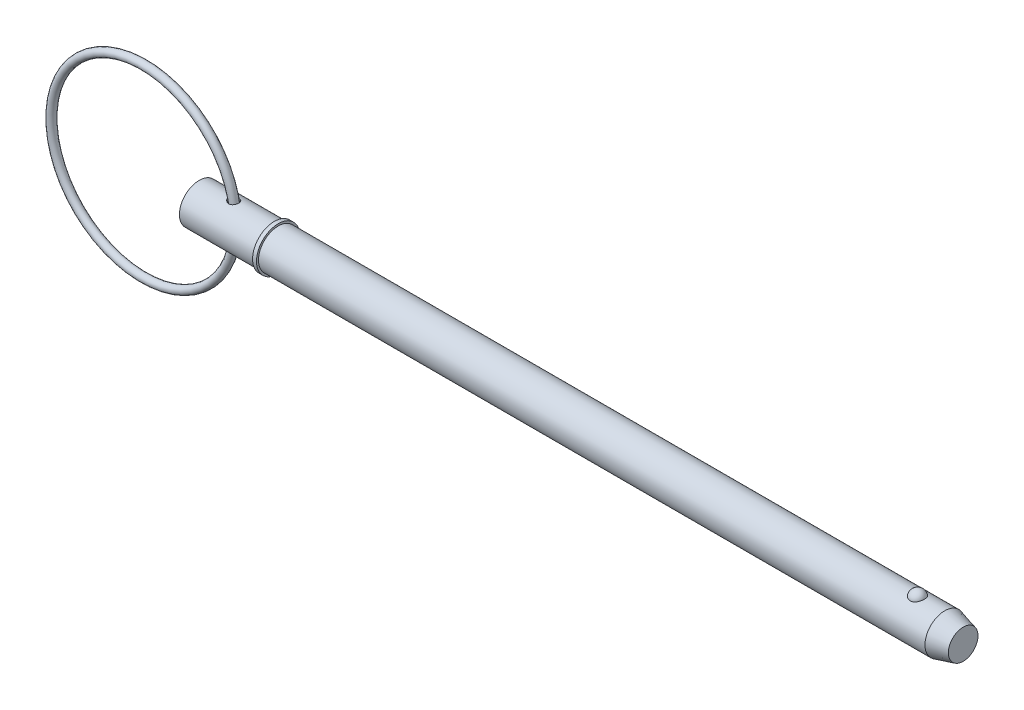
ISO-10303-21;
HEADER;
FILE_DESCRIPTION(('STEP AP214'),'2;1');
FILE_NAME('part.step','',(''),(''),'','','');
FILE_SCHEMA(('AUTOMOTIVE_DESIGN { 1 0 10303 214 1 1 1 1 }'));
ENDSEC;
DATA;
#1=APPLICATION_CONTEXT('core data for automotive mechanical design processes');
#2=APPLICATION_PROTOCOL_DEFINITION('international standard','automotive_design',2000,#1);
#3=PRODUCT_CONTEXT('',#1,'mechanical');
#4=PRODUCT('Part','Part','',(#3));
#5=PRODUCT_RELATED_PRODUCT_CATEGORY('part','',(#4));
#6=PRODUCT_DEFINITION_FORMATION('','',#4);
#7=PRODUCT_DEFINITION_CONTEXT('part definition',#1,'design');
#8=PRODUCT_DEFINITION('design','',#6,#7);
#9=PRODUCT_DEFINITION_SHAPE('','',#8);
#10=(LENGTH_UNIT() NAMED_UNIT(*) SI_UNIT(.MILLI.,.METRE.));
#11=(NAMED_UNIT(*) PLANE_ANGLE_UNIT() SI_UNIT($,.RADIAN.));
#12=(NAMED_UNIT(*) SI_UNIT($,.STERADIAN.) SOLID_ANGLE_UNIT());
#13=UNCERTAINTY_MEASURE_WITH_UNIT(LENGTH_MEASURE(1.E-05),#10,'distance_accuracy_value','');
#14=(GEOMETRIC_REPRESENTATION_CONTEXT(3) GLOBAL_UNCERTAINTY_ASSIGNED_CONTEXT((#13)) GLOBAL_UNIT_ASSIGNED_CONTEXT((#10,
#11,#12)) REPRESENTATION_CONTEXT('',''));
#15=CARTESIAN_POINT('',(0.,0.,0.));
#16=DIRECTION('',(0.,0.,1.));
#17=DIRECTION('',(1.,0.,0.));
#18=AXIS2_PLACEMENT_3D('',#15,#16,#17);
#19=CARTESIAN_POINT('',(-13.4013067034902,0.,0.));
#20=DIRECTION('',(0.,0.,1.));
#21=DIRECTION('',(1.,0.,0.));
#22=AXIS2_PLACEMENT_3D('',#19,#20,#21);
#23=TOROIDAL_SURFACE('',#22,22.225,0.952999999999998);
#24=CARTESIAN_POINT('',(9.77669329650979,0.,0.));
#25=VERTEX_POINT('',#24);
#26=VERTEX_LOOP('',#25);
#27=FACE_BOUND('',#26,.T.);
#28=ADVANCED_FACE('P0_F12',(#27),#23,.T.);
#29=CLOSED_SHELL('',(#28));
#30=MANIFOLD_SOLID_BREP('P0_B1',#29);
#31=CARTESIAN_POINT('',(0.,0.,0.));
#32=DIRECTION('',(1.,0.,0.));
#33=DIRECTION('',(0.,0.,-1.));
#34=AXIS2_PLACEMENT_3D('',#31,#32,#33);
#35=CYLINDRICAL_SURFACE('',#34,4.765);
#36=CARTESIAN_POINT('',(7.31773584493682,4.71580709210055,-0.682926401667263));
#37=CARTESIAN_POINT('',(7.3607471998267,4.70750812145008,-0.740230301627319));
#38=CARTESIAN_POINT('',(7.40883112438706,4.69869300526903,-0.79371122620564));
#39=CARTESIAN_POINT('',(7.51340999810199,4.68106981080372,-0.89180043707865));
#40=CARTESIAN_POINT('',(7.56991882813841,4.67226176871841,-0.936393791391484));
#41=CARTESIAN_POINT('',(7.689548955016,4.65568581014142,-1.01560363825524));
#42=CARTESIAN_POINT('',(7.75265928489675,4.64791621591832,-1.05023633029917));
#43=CARTESIAN_POINT('',(7.88387110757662,4.6343185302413,-1.10870278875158));
#44=CARTESIAN_POINT('',(7.95197058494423,4.62848966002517,-1.13254088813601));
#45=CARTESIAN_POINT('',(8.09209413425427,4.6194749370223,-1.16877415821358));
#46=CARTESIAN_POINT('',(8.16415141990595,4.6163169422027,-1.18104886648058));
#47=CARTESIAN_POINT('',(8.30937958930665,4.61324608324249,-1.19299123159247));
#48=CARTESIAN_POINT('',(8.38255011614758,4.61333220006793,-1.19266284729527));
#49=CARTESIAN_POINT('',(8.52374186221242,4.61674026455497,-1.17939593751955));
#50=CARTESIAN_POINT('',(8.59183022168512,4.61989017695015,-1.16712781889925));
#51=CARTESIAN_POINT('',(8.72470143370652,4.62884731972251,-1.13107903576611));
#52=CARTESIAN_POINT('',(8.78948513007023,4.63465386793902,-1.10730132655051));
#53=CARTESIAN_POINT('',(8.91088768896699,4.64792402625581,-1.05016249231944));
#54=CARTESIAN_POINT('',(8.96774302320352,4.65530108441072,-1.01728198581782));
#55=CARTESIAN_POINT('',(9.07499804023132,4.67102002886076,-0.942471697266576));
#56=CARTESIAN_POINT('',(9.12539777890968,4.6793619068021,-0.900541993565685));
#57=CARTESIAN_POINT('',(9.21836221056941,4.69607497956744,-0.808868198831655));
#58=CARTESIAN_POINT('',(9.26093651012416,4.70444612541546,-0.759133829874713));
#59=CARTESIAN_POINT('',(9.33728390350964,4.72032100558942,-0.653192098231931));
#60=CARTESIAN_POINT('',(9.3710564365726,4.72782468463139,-0.596984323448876));
#61=CARTESIAN_POINT('',(9.42940600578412,4.74126034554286,-0.478808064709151));
#62=CARTESIAN_POINT('',(9.45384681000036,4.74716869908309,-0.416769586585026));
#63=CARTESIAN_POINT('',(9.49226260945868,4.75663465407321,-0.289362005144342));
#64=CARTESIAN_POINT('',(9.50623742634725,4.76019221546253,-0.22399284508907));
#65=CARTESIAN_POINT('',(9.52342004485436,4.76458450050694,-0.0914886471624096));
#66=CARTESIAN_POINT('',(9.52658321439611,4.7654079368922,-0.0243474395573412));
#67=CARTESIAN_POINT('',(9.52194012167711,4.76421136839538,0.109528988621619));
#68=CARTESIAN_POINT('',(9.51413380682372,4.7621913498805,0.176264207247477));
#69=CARTESIAN_POINT('',(9.48775485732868,4.75552896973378,0.307367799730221));
#70=CARTESIAN_POINT('',(9.4691926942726,4.75088915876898,0.371738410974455));
#71=CARTESIAN_POINT('',(9.42175836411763,4.73949008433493,0.496364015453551));
#72=CARTESIAN_POINT('',(9.39288586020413,4.73273075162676,0.556618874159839));
#73=CARTESIAN_POINT('',(9.32549385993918,4.71782154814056,0.671371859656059));
#74=CARTESIAN_POINT('',(9.28696367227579,4.70967013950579,0.725863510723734));
#75=CARTESIAN_POINT('',(9.20123305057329,4.6928883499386,0.827453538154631));
#76=CARTESIAN_POINT('',(9.15403300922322,4.68425799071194,0.874552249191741));
#77=CARTESIAN_POINT('',(9.05250467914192,4.66754854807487,0.959736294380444));
#78=CARTESIAN_POINT('',(8.99822095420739,4.65946646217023,0.997874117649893));
#79=CARTESIAN_POINT('',(8.88381123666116,4.64472049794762,1.06440739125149));
#80=CARTESIAN_POINT('',(8.82368614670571,4.63805640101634,1.09280434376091));
#81=CARTESIAN_POINT('',(8.70022952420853,4.62698068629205,1.13878427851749));
#82=CARTESIAN_POINT('',(8.63695594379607,4.62253830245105,1.15651569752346));
#83=CARTESIAN_POINT('',(8.50825296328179,4.61622454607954,1.18146656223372));
#84=CARTESIAN_POINT('',(8.44282353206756,4.61435321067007,1.18868585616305));
#85=CARTESIAN_POINT('',(8.31119087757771,4.61332122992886,1.19268442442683));
#86=CARTESIAN_POINT('',(8.24498542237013,4.61417920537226,1.18939198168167));
#87=CARTESIAN_POINT('',(8.11397487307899,4.61847671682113,1.17259121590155));
#88=CARTESIAN_POINT('',(8.04917011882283,4.62191687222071,1.15908044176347));
#89=CARTESIAN_POINT('',(7.91946226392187,4.63117528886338,1.12153047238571));
#90=CARTESIAN_POINT('',(7.85470460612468,4.6371000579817,1.09701575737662));
#91=CARTESIAN_POINT('',(7.7300035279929,4.65063246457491,1.03814807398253));
#92=CARTESIAN_POINT('',(7.67006197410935,4.65824075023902,1.00379131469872));
#93=CARTESIAN_POINT('',(7.55352765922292,4.67473656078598,0.924015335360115));
#94=CARTESIAN_POINT('',(7.49726947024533,4.68366994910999,0.878115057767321));
#95=CARTESIAN_POINT('',(7.39344083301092,4.70144936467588,0.777311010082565));
#96=CARTESIAN_POINT('',(7.34587087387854,4.71029538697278,0.722406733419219));
#97=CARTESIAN_POINT('',(7.26188955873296,4.72669773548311,0.605773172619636));
#98=CARTESIAN_POINT('',(7.22531316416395,4.73427229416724,0.544165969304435));
#99=CARTESIAN_POINT('',(7.16406269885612,4.74732663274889,0.415095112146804));
#100=CARTESIAN_POINT('',(7.13937848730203,4.75280819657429,0.347636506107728));
#101=CARTESIAN_POINT('',(7.10494917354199,4.7605495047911,0.215359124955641));
#102=CARTESIAN_POINT('',(7.09405441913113,4.76305589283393,0.150853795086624));
#103=CARTESIAN_POINT('',(7.08387189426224,4.76539656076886,0.0208839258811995));
#104=CARTESIAN_POINT('',(7.0845805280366,4.76523166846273,-0.0445803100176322));
#105=CARTESIAN_POINT('',(7.09709111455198,4.76236014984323,-0.169693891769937));
#106=CARTESIAN_POINT('',(7.10810913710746,4.75983315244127,-0.229428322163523));
#107=CARTESIAN_POINT('',(7.13959099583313,4.75276726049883,-0.346187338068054));
#108=CARTESIAN_POINT('',(7.16004881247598,4.7482296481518,-0.403213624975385));
#109=CARTESIAN_POINT('',(7.20270325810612,4.73907067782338,-0.498040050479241));
#110=CARTESIAN_POINT('',(7.22286864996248,4.73481668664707,-0.536809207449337));
#111=CARTESIAN_POINT('',(7.26730952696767,4.72570777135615,-0.611832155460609));
#112=CARTESIAN_POINT('',(7.29158512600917,4.72085283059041,-0.64808587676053));
#113=CARTESIAN_POINT('',(7.31773584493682,4.71580709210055,-0.682926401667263));
#114=B_SPLINE_CURVE_WITH_KNOTS('',3,(#36,#37,#38,#39,#40,#41,#42,#43,#44,#45,#46,#47,#48,#49,
#50,#51,#52,#53,#54,#55,#56,#57,#58,#59,#60,#61,#62,#63,#64,#65,#66,#67,#68,#69,#70,#71,#72,#73,
#74,#75,#76,#77,#78,#79,#80,#81,#82,#83,#84,#85,#86,#87,#88,#89,#90,#91,#92,#93,#94,#95,#96,#97,
#98,#99,#100,#101,#102,#103,#104,#105,#106,#107,#108,#109,#110,#111,#112,#113),.UNSPECIFIED.,
.T.,.F.,(4,2,2,2,2,2,2,2,2,2,2,2,2,2,2,2,2,2,2,2,2,2,2,2,2,2,2,2,2,2,2,2,2,2,2,2,2,2,4),(0.,
0.216219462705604,0.432799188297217,0.649024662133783,0.865163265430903,1.08352938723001,
1.30182691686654,1.50853487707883,1.71518978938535,1.91252381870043,2.1098561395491,
2.30694457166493,2.50404555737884,2.70392296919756,2.90380378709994,3.10450875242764,
3.30521468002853,3.5057255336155,3.70624293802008,3.90698330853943,4.10771458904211,
4.30723900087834,4.50673262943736,4.70338139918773,4.90003300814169,5.09802914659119,
5.29607279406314,5.5036500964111,5.7113074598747,5.92972727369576,6.14815938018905,
6.36312650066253,6.57790998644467,6.77325899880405,6.96854747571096,7.15009726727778,
7.33153144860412,7.46298830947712,7.59444881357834),.UNSPECIFIED.);
#115=CARTESIAN_POINT('',(7.31773584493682,4.71580709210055,-0.682926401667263));
#116=VERTEX_POINT('',#115);
#117=EDGE_CURVE('P1_E42',#116,#116,#114,.T.);
#118=ORIENTED_EDGE('',*,*,#117,.T.);
#119=EDGE_LOOP('',(#118));
#120=FACE_BOUND('',#119,.T.);
#121=CARTESIAN_POINT('',(0.,0.,0.));
#122=DIRECTION('',(1.,0.,0.));
#123=DIRECTION('',(0.,0.,-1.));
#124=AXIS2_PLACEMENT_3D('',#121,#122,#123);
#125=CIRCLE('',#124,4.765);
#126=CARTESIAN_POINT('',(0.,0.,-4.765));
#127=VERTEX_POINT('',#126);
#128=EDGE_CURVE('P1_E9',#127,#127,#125,.T.);
#129=ORIENTED_EDGE('',*,*,#128,.T.);
#130=EDGE_LOOP('',(#129));
#131=FACE_BOUND('',#130,.T.);
#132=CARTESIAN_POINT('',(18.097,0.,0.));
#133=DIRECTION('',(1.,0.,0.));
#134=DIRECTION('',(0.,0.,-1.));
#135=AXIS2_PLACEMENT_3D('',#132,#133,#134);
#136=CIRCLE('',#135,4.765);
#137=CARTESIAN_POINT('',(18.097,0.,-4.765));
#138=VERTEX_POINT('',#137);
#139=EDGE_CURVE('P1_E25',#138,#138,#136,.T.);
#140=ORIENTED_EDGE('',*,*,#139,.F.);
#141=EDGE_LOOP('',(#140));
#142=FACE_BOUND('',#141,.T.);
#143=CARTESIAN_POINT('',(7.31773584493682,-4.71580709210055,-0.682926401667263));
#144=CARTESIAN_POINT('',(7.27956054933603,-4.72317282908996,-0.63206220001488));
#145=CARTESIAN_POINT('',(7.24535712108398,-4.7301361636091,-0.578155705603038));
#146=CARTESIAN_POINT('',(7.18611785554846,-4.74256090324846,-0.465352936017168));
#147=CARTESIAN_POINT('',(7.16107836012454,-4.74802290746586,-0.406458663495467));
#148=CARTESIAN_POINT('',(7.12119149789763,-4.75686558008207,-0.284913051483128));
#149=CARTESIAN_POINT('',(7.1063796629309,-4.76023898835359,-0.222249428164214));
#150=CARTESIAN_POINT('',(7.08786546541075,-4.76447177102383,-0.0952170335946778));
#151=CARTESIAN_POINT('',(7.08416018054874,-4.76533180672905,-0.0308487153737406));
#152=CARTESIAN_POINT('',(7.08795686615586,-4.76445764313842,0.0942755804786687));
#153=CARTESIAN_POINT('',(7.09490366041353,-4.762851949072,0.155050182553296));
#154=CARTESIAN_POINT('',(7.11863973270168,-4.75746086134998,0.2745356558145));
#155=CARTESIAN_POINT('',(7.13542953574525,-4.75367535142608,0.333246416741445));
#156=CARTESIAN_POINT('',(7.17817193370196,-4.74430545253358,0.447305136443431));
#157=CARTESIAN_POINT('',(7.20415836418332,-4.73871442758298,0.502639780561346));
#158=CARTESIAN_POINT('',(7.26428068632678,-4.72628508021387,0.608523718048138));
#159=CARTESIAN_POINT('',(7.29841897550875,-4.71944639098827,0.659071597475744));
#160=CARTESIAN_POINT('',(7.37680984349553,-4.70456239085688,0.758311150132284));
#161=CARTESIAN_POINT('',(7.42165519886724,-4.69646426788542,0.806526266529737));
#162=CARTESIAN_POINT('',(7.51828933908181,-4.68032890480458,0.895428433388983));
#163=CARTESIAN_POINT('',(7.57008134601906,-4.67229169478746,0.936111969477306));
#164=CARTESIAN_POINT('',(7.68397204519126,-4.65640659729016,1.01229731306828));
#165=CARTESIAN_POINT('',(7.74657226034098,-4.64863251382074,1.04706751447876));
#166=CARTESIAN_POINT('',(7.87680110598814,-4.6349740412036,1.10596507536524));
#167=CARTESIAN_POINT('',(7.94443054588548,-4.62908995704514,1.13009071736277));
#168=CARTESIAN_POINT('',(8.08402017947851,-4.61989019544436,1.16713943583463));
#169=CARTESIAN_POINT('',(8.15603143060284,-4.61661596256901,1.17988211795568));
#170=CARTESIAN_POINT('',(8.30124697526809,-4.61330446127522,1.1927680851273));
#171=CARTESIAN_POINT('',(8.37445077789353,-4.61326589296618,1.19291642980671));
#172=CARTESIAN_POINT('',(8.51584800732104,-4.61644036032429,1.18056687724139));
#173=CARTESIAN_POINT('',(8.58410302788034,-4.61948317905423,1.16873099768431));
#174=CARTESIAN_POINT('',(8.71738052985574,-4.6282520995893,1.13350536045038));
#175=CARTESIAN_POINT('',(8.78240382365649,-4.63397752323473,1.11011852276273));
#176=CARTESIAN_POINT('',(8.90428519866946,-4.64711877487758,1.05371003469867));
#177=CARTESIAN_POINT('',(8.96138096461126,-4.6544450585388,1.02117932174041));
#178=CARTESIAN_POINT('',(9.06916653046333,-4.6700970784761,0.947021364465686));
#179=CARTESIAN_POINT('',(9.11985639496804,-4.67842280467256,0.905394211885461));
#180=CARTESIAN_POINT('',(9.2134071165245,-4.69513303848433,0.814300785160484));
#181=CARTESIAN_POINT('',(9.25628268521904,-4.70351740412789,0.764849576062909));
#182=CARTESIAN_POINT('',(9.33327173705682,-4.71945185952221,0.659422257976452));
#183=CARTESIAN_POINT('',(9.3673846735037,-4.72700189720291,0.603445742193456));
#184=CARTESIAN_POINT('',(9.42645214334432,-4.74055953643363,0.485673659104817));
#185=CARTESIAN_POINT('',(9.45127042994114,-4.74654383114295,0.423807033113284));
#186=CARTESIAN_POINT('',(9.49046298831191,-4.756182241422,0.296676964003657));
#187=CARTESIAN_POINT('',(9.50483706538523,-4.75983631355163,0.231413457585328));
#188=CARTESIAN_POINT('',(9.52283408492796,-4.76443282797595,0.0990368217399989));
#189=CARTESIAN_POINT('',(9.52641016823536,-4.76536345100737,0.0319169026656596));
#190=CARTESIAN_POINT('',(9.52259067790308,-4.76437893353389,-0.101988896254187));
#191=CARTESIAN_POINT('',(9.5151950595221,-4.76246378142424,-0.168774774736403));
#192=CARTESIAN_POINT('',(9.48962516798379,-4.75599746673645,-0.300048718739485));
#193=CARTESIAN_POINT('',(9.4714615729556,-4.75144891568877,-0.364538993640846));
#194=CARTESIAN_POINT('',(9.42480303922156,-4.74020887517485,-0.489470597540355));
#195=CARTESIAN_POINT('',(9.396307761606,-4.73351731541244,-0.549911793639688));
#196=CARTESIAN_POINT('',(9.32963953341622,-4.71871240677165,-0.665099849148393));
#197=CARTESIAN_POINT('',(9.29145577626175,-4.71059747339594,-0.719840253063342));
#198=CARTESIAN_POINT('',(9.20637695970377,-4.69385254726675,-0.82198328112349));
#199=CARTESIAN_POINT('',(9.15948227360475,-4.68522257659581,-0.869386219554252));
#200=CARTESIAN_POINT('',(9.05849937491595,-4.66847516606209,-0.955233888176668));
#201=CARTESIAN_POINT('',(9.00445430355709,-4.6603550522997,-0.993728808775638));
#202=CARTESIAN_POINT('',(8.8904576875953,-4.64550122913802,-1.06100691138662));
#203=CARTESIAN_POINT('',(8.83050704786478,-4.63876730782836,-1.08979157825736));
#204=CARTESIAN_POINT('',(8.70732873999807,-4.6275305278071,-1.13655620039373));
#205=CARTESIAN_POINT('',(8.64416019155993,-4.62299714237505,-1.15468477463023));
#206=CARTESIAN_POINT('',(8.51559711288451,-4.61649071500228,-1.18043067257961));
#207=CARTESIAN_POINT('',(8.4502025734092,-4.61451768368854,-1.18804795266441));
#208=CARTESIAN_POINT('',(8.31862013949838,-4.61328355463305,-1.19283094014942));
#209=CARTESIAN_POINT('',(8.25242983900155,-4.61403911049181,-1.18993246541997));
#210=CARTESIAN_POINT('',(8.12138461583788,-4.61814057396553,-1.17391149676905));
#211=CARTESIAN_POINT('',(8.0565300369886,-4.62148714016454,-1.16078640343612));
#212=CARTESIAN_POINT('',(7.92669960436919,-4.63056912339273,-1.12402333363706));
#213=CARTESIAN_POINT('',(7.86186447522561,-4.63641051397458,-1.09991536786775));
#214=CARTESIAN_POINT('',(7.73694230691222,-4.64980121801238,-1.04185298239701));
#215=CARTESIAN_POINT('',(7.6768568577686,-4.65735110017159,-1.0078952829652));
#216=CARTESIAN_POINT('',(7.56207884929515,-4.67346080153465,-0.930364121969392));
#217=CARTESIAN_POINT('',(7.5074784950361,-4.68203382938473,-0.886656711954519));
#218=CARTESIAN_POINT('',(7.40624045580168,-4.69916824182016,-0.79082583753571));
#219=CARTESIAN_POINT('',(7.35959988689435,-4.7077296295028,-0.738705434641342));
#220=CARTESIAN_POINT('',(7.31773584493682,-4.71580709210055,-0.682926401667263));
#221=B_SPLINE_CURVE_WITH_KNOTS('',3,(#143,#144,#145,#146,#147,#148,#149,#150,#151,#152,#153,
#154,#155,#156,#157,#158,#159,#160,#161,#162,#163,#164,#165,#166,#167,#168,#169,#170,#171,#172,
#173,#174,#175,#176,#177,#178,#179,#180,#181,#182,#183,#184,#185,#186,#187,#188,#189,#190,#191,
#192,#193,#194,#195,#196,#197,#198,#199,#200,#201,#202,#203,#204,#205,#206,#207,#208,#209,#210,
#211,#212,#213,#214,#215,#216,#217,#218,#219,#220),.UNSPECIFIED.,.T.,.F.,(4,2,2,2,2,2,2,2,2,2,2,
2,2,2,2,2,2,2,2,2,2,2,2,2,2,2,2,2,2,2,2,2,2,2,2,2,2,2,4),(0.,0.191851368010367,0.38362606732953,
0.576063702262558,0.768450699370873,0.951145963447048,1.13385097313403,1.31723528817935,
1.50067360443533,1.69887079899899,1.8971602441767,2.11225870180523,2.32739185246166,
2.54587681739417,2.76427400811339,2.97123130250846,3.17813630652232,3.37555441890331,
3.57297054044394,3.77001106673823,3.96706388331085,4.16690159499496,4.36674303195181,
4.56745046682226,4.76815872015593,4.96866827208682,5.16918440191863,5.36992517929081,
5.5706573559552,5.77022940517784,5.96977092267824,6.16645904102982,6.36314797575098,
6.56103940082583,6.75898114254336,6.96633026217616,7.17374850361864,7.384214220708,
7.59460352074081),.UNSPECIFIED.);
#222=CARTESIAN_POINT('',(7.31773584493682,-4.71580709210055,-0.682926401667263));
#223=VERTEX_POINT('',#222);
#224=EDGE_CURVE('P1_E17',#223,#223,#221,.T.);
#225=ORIENTED_EDGE('',*,*,#224,.T.);
#226=EDGE_LOOP('',(#225));
#227=FACE_BOUND('',#226,.T.);
#228=ADVANCED_FACE('P1_F13',(#120,#131,#142,#227),#35,.T.);
#229=CARTESIAN_POINT('',(0.,0.,0.));
#230=DIRECTION('',(1.,0.,0.));
#231=DIRECTION('',(0.,0.,-1.));
#232=AXIS2_PLACEMENT_3D('',#229,#230,#231);
#233=CYLINDRICAL_SURFACE('',#232,4.765);
#234=CARTESIAN_POINT('',(179.704194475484,0.,0.));
#235=DIRECTION('',(1.,0.,0.));
#236=DIRECTION('',(0.,0.,-1.));
#237=AXIS2_PLACEMENT_3D('',#234,#235,#236);
#238=CIRCLE('',#237,4.765);
#239=CARTESIAN_POINT('',(179.704194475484,0.,-4.765));
#240=VERTEX_POINT('',#239);
#241=EDGE_CURVE('P1_E99',#240,#240,#238,.T.);
#242=ORIENTED_EDGE('',*,*,#241,.F.);
#243=EDGE_LOOP('',(#242));
#244=FACE_BOUND('',#243,.T.);
#245=CARTESIAN_POINT('',(19.05,0.,0.));
#246=DIRECTION('',(1.,0.,0.));
#247=DIRECTION('',(0.,0.,-1.));
#248=AXIS2_PLACEMENT_3D('',#245,#246,#247);
#249=CIRCLE('',#248,4.765);
#250=CARTESIAN_POINT('',(19.05,0.,-4.765));
#251=VERTEX_POINT('',#250);
#252=EDGE_CURVE('P1_E96',#251,#251,#249,.T.);
#253=ORIENTED_EDGE('',*,*,#252,.T.);
#254=EDGE_LOOP('',(#253));
#255=FACE_BOUND('',#254,.T.);
#256=CARTESIAN_POINT('',(173.151020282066,4.42764777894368,1.76101111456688));
#257=CARTESIAN_POINT('',(173.059721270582,4.42764470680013,1.76101422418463));
#258=CARTESIAN_POINT('',(172.968446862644,4.43059091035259,1.75366340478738));
#259=CARTESIAN_POINT('',(172.788615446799,4.44201846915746,1.72451180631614));
#260=CARTESIAN_POINT('',(172.700057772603,4.45049845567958,1.70271460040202));
#261=CARTESIAN_POINT('',(172.528257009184,4.47200516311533,1.64539370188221));
#262=CARTESIAN_POINT('',(172.445006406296,4.48502527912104,1.60988994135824));
#263=CARTESIAN_POINT('',(172.285763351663,4.51419542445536,1.52617873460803));
#264=CARTESIAN_POINT('',(172.209772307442,4.53034605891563,1.47796883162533));
#265=CARTESIAN_POINT('',(172.064744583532,4.56459317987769,1.36860494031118));
#266=CARTESIAN_POINT('',(171.995964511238,4.58273170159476,1.30712420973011));
#267=CARTESIAN_POINT('',(171.869342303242,4.61870302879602,1.17370204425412));
#268=CARTESIAN_POINT('',(171.811502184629,4.63653577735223,1.10175868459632));
#269=CARTESIAN_POINT('',(171.705570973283,4.67090140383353,0.945806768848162));
#270=CARTESIAN_POINT('',(171.658030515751,4.68734068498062,0.861402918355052));
#271=CARTESIAN_POINT('',(171.577081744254,4.71628466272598,0.685442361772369));
#272=CARTESIAN_POINT('',(171.543674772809,4.72878898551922,0.593884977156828));
#273=CARTESIAN_POINT('',(171.491287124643,4.74874061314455,0.404781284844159));
#274=CARTESIAN_POINT('',(171.472517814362,4.75611366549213,0.307168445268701));
#275=CARTESIAN_POINT('',(171.450584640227,4.76475393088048,0.109940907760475));
#276=CARTESIAN_POINT('',(171.447420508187,4.76602124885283,0.0103262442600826));
#277=CARTESIAN_POINT('',(171.456740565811,4.76232928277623,-0.187629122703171));
#278=CARTESIAN_POINT('',(171.469158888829,4.7573962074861,-0.285973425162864));
#279=CARTESIAN_POINT('',(171.509280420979,4.74184975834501,-0.479027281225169));
#280=CARTESIAN_POINT('',(171.536983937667,4.7312362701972,-0.573736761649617));
#281=CARTESIAN_POINT('',(171.607158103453,4.70540026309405,-0.756973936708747));
#282=CARTESIAN_POINT('',(171.649646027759,4.69017235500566,-0.845494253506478));
#283=CARTESIAN_POINT('',(171.748520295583,4.65669867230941,-1.01378033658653));
#284=CARTESIAN_POINT('',(171.804907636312,4.63845268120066,-1.09354547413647));
#285=CARTESIAN_POINT('',(171.930552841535,4.60085438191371,-1.24228523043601));
#286=CARTESIAN_POINT('',(171.999843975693,4.58149930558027,-1.31123108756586));
#287=CARTESIAN_POINT('',(172.149606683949,4.54391653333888,-1.43607409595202));
#288=CARTESIAN_POINT('',(172.230077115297,4.52568872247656,-1.49197257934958));
#289=CARTESIAN_POINT('',(172.398150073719,4.49293007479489,-1.58786764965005));
#290=CARTESIAN_POINT('',(172.485544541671,4.47832346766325,-1.62820219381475));
#291=CARTESIAN_POINT('',(172.666553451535,4.45406011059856,-1.69345757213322));
#292=CARTESIAN_POINT('',(172.76016555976,4.44440151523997,-1.71838415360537));
#293=CARTESIAN_POINT('',(172.945893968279,4.43159888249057,-1.75112843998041));
#294=CARTESIAN_POINT('',(173.037849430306,4.42815213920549,-1.75974223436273));
#295=CARTESIAN_POINT('',(173.221965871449,4.427247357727,-1.76201865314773));
#296=CARTESIAN_POINT('',(173.314126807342,4.42978816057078,-1.7556841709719));
#297=CARTESIAN_POINT('',(173.493129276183,4.44038648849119,-1.72869560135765));
#298=CARTESIAN_POINT('',(173.580047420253,4.44827555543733,-1.70847853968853));
#299=CARTESIAN_POINT('',(173.749131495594,4.46852246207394,-1.65479562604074));
#300=CARTESIAN_POINT('',(173.831297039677,4.48088066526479,-1.62132869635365));
#301=CARTESIAN_POINT('',(173.990591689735,4.50907357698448,-1.54120560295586));
#302=CARTESIAN_POINT('',(174.067570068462,4.52497884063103,-1.49427526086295));
#303=CARTESIAN_POINT('',(174.212708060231,4.55845148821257,-1.38881222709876));
#304=CARTESIAN_POINT('',(174.280865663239,4.57601924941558,-1.3302768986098));
#305=CARTESIAN_POINT('',(174.410099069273,4.61196537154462,-1.1999104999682));
#306=CARTESIAN_POINT('',(174.470656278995,4.63034074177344,-1.12756415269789));
#307=CARTESIAN_POINT('',(174.579279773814,4.66513959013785,-0.97361299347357));
#308=CARTESIAN_POINT('',(174.627343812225,4.68156271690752,-0.892006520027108));
#309=CARTESIAN_POINT('',(174.711383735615,4.71130224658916,-0.718892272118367));
#310=CARTESIAN_POINT('',(174.746918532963,4.724501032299,-0.62714967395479));
#311=CARTESIAN_POINT('',(174.802952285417,4.74571823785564,-0.438611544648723));
#312=CARTESIAN_POINT('',(174.823450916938,4.75373654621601,-0.341815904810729));
#313=CARTESIAN_POINT('',(174.849033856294,4.76378905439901,-0.14563306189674));
#314=CARTESIAN_POINT('',(174.854076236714,4.76580697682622,-0.0462395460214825));
#315=CARTESIAN_POINT('',(174.848523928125,4.7636057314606,0.152038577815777));
#316=CARTESIAN_POINT('',(174.837929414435,4.75938663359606,0.250923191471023));
#317=CARTESIAN_POINT('',(174.801387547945,4.74516937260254,0.4450044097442));
#318=CARTESIAN_POINT('',(174.775496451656,4.73519238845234,0.540213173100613));
#319=CARTESIAN_POINT('',(174.708927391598,4.71049394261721,0.72466221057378));
#320=CARTESIAN_POINT('',(174.668248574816,4.69577220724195,0.813902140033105));
#321=CARTESIAN_POINT('',(174.572717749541,4.66303767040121,0.984313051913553));
#322=CARTESIAN_POINT('',(174.517804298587,4.64501070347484,1.06544688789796));
#323=CARTESIAN_POINT('',(174.395049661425,4.60764678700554,1.21692673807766));
#324=CARTESIAN_POINT('',(174.327208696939,4.58830985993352,1.28727293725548));
#325=CARTESIAN_POINT('',(174.180548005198,4.55060370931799,1.41479271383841));
#326=CARTESIAN_POINT('',(174.101791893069,4.53222967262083,1.47203785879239));
#327=CARTESIAN_POINT('',(173.934989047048,4.49849576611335,1.57212016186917));
#328=CARTESIAN_POINT('',(173.846941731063,4.48313608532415,1.6149564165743));
#329=CARTESIAN_POINT('',(173.659791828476,4.45676184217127,1.68642657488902));
#330=CARTESIAN_POINT('',(173.560365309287,4.44598302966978,1.71430590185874));
#331=CARTESIAN_POINT('',(173.357621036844,4.43142918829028,1.7515925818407));
#332=CARTESIAN_POINT('',(173.254304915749,4.42765125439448,1.76100759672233));
#333=CARTESIAN_POINT('',(173.151020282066,4.42764777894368,1.76101111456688));
#334=B_SPLINE_CURVE_WITH_KNOTS('',3,(#256,#257,#258,#259,#260,#261,#262,#263,#264,#265,#266,
#267,#268,#269,#270,#271,#272,#273,#274,#275,#276,#277,#278,#279,#280,#281,#282,#283,#284,#285,
#286,#287,#288,#289,#290,#291,#292,#293,#294,#295,#296,#297,#298,#299,#300,#301,#302,#303,#304,
#305,#306,#307,#308,#309,#310,#311,#312,#313,#314,#315,#316,#317,#318,#319,#320,#321,#322,#323,
#324,#325,#326,#327,#328,#329,#330,#331,#332,#333),.UNSPECIFIED.,.T.,.F.,(4,2,2,2,2,2,2,2,2,2,2,
2,2,2,2,2,2,2,2,2,2,2,2,2,2,2,2,2,2,2,2,2,2,2,2,2,2,2,4),(0.,0.273517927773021,
0.546968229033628,0.820022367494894,1.09312934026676,1.37393946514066,1.6548013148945,
1.94820420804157,2.24163496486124,2.53922817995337,2.83681628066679,3.13315071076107,
3.42949110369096,3.72617893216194,4.02288805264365,4.32037303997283,4.61782764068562,
4.90840095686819,5.19886582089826,5.47474855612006,5.75057789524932,6.0180997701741,
6.28564340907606,6.55907787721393,6.83257454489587,7.11962987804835,7.40673679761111,
7.70312663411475,7.9995228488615,8.29672237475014,8.59391856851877,8.89002850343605,
9.18615552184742,9.48358266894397,9.7810047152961,10.0767610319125,10.3725358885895,
10.6820893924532,10.991514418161),.UNSPECIFIED.);
#335=CARTESIAN_POINT('',(173.151020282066,4.42764777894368,1.76101111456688));
#336=VERTEX_POINT('',#335);
#337=EDGE_CURVE('P1_E34',#336,#336,#334,.T.);
#338=ORIENTED_EDGE('',*,*,#337,.T.);
#339=EDGE_LOOP('',(#338));
#340=FACE_BOUND('',#339,.T.);
#341=ADVANCED_FACE('P1_F46',(#244,#255,#340),#233,.T.);
#342=CARTESIAN_POINT('',(0.,0.,0.));
#343=DIRECTION('',(-1.,0.,0.));
#344=DIRECTION('',(0.,0.,1.));
#345=AXIS2_PLACEMENT_3D('',#342,#343,#344);
#346=PLANE('',#345);
#347=ORIENTED_EDGE('',*,*,#128,.F.);
#348=EDGE_LOOP('',(#347));
#349=FACE_BOUND('',#348,.T.);
#350=ADVANCED_FACE('P1_F15',(#349),#346,.T.);
#351=CARTESIAN_POINT('',(18.097,4.765,0.));
#352=DIRECTION('',(-1.,0.,0.));
#353=DIRECTION('',(0.,0.,1.));
#354=AXIS2_PLACEMENT_3D('',#351,#352,#353);
#355=PLANE('',#354);
#356=ORIENTED_EDGE('',*,*,#139,.T.);
#357=EDGE_LOOP('',(#356));
#358=FACE_BOUND('',#357,.T.);
#359=CARTESIAN_POINT('',(18.097,0.,0.));
#360=DIRECTION('',(1.,0.,0.));
#361=DIRECTION('',(0.,0.,-1.));
#362=AXIS2_PLACEMENT_3D('',#359,#360,#361);
#363=CIRCLE('',#362,5.2415);
#364=CARTESIAN_POINT('',(18.097,0.,-5.2415));
#365=VERTEX_POINT('',#364);
#366=EDGE_CURVE('P1_E30',#365,#365,#363,.T.);
#367=ORIENTED_EDGE('',*,*,#366,.F.);
#368=EDGE_LOOP('',(#367));
#369=FACE_BOUND('',#368,.T.);
#370=ADVANCED_FACE('P1_F81',(#358,#369),#355,.T.);
#371=CARTESIAN_POINT('',(0.,0.,0.));
#372=DIRECTION('',(1.,0.,0.));
#373=DIRECTION('',(0.,0.,-1.));
#374=AXIS2_PLACEMENT_3D('',#371,#372,#373);
#375=CYLINDRICAL_SURFACE('',#374,5.2415);
#376=ORIENTED_EDGE('',*,*,#366,.T.);
#377=EDGE_LOOP('',(#376));
#378=FACE_BOUND('',#377,.T.);
#379=CARTESIAN_POINT('',(19.05,0.,0.));
#380=DIRECTION('',(1.,0.,0.));
#381=DIRECTION('',(0.,0.,-1.));
#382=AXIS2_PLACEMENT_3D('',#379,#380,#381);
#383=CIRCLE('',#382,5.2415);
#384=CARTESIAN_POINT('',(19.05,0.,-5.2415));
#385=VERTEX_POINT('',#384);
#386=EDGE_CURVE('P1_E95',#385,#385,#383,.T.);
#387=ORIENTED_EDGE('',*,*,#386,.F.);
#388=EDGE_LOOP('',(#387));
#389=FACE_BOUND('',#388,.T.);
#390=ADVANCED_FACE('P1_F68',(#378,#389),#375,.T.);
#391=CARTESIAN_POINT('',(19.05,5.2415,0.));
#392=DIRECTION('',(1.,0.,0.));
#393=DIRECTION('',(0.,0.,-1.));
#394=AXIS2_PLACEMENT_3D('',#391,#392,#393);
#395=PLANE('',#394);
#396=ORIENTED_EDGE('',*,*,#386,.T.);
#397=EDGE_LOOP('',(#396));
#398=FACE_BOUND('',#397,.T.);
#399=ORIENTED_EDGE('',*,*,#252,.F.);
#400=EDGE_LOOP('',(#399));
#401=FACE_BOUND('',#400,.T.);
#402=ADVANCED_FACE('P1_F62',(#398,#401),#395,.T.);
#403=CARTESIAN_POINT('',(184.15,0.,0.));
#404=DIRECTION('',(-1.,0.,0.));
#405=DIRECTION('',(0.,0.,1.));
#406=AXIS2_PLACEMENT_3D('',#403,#404,#405);
#407=CONICAL_SURFACE('',#406,3.57375000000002,0.261799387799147);
#408=ORIENTED_EDGE('',*,*,#241,.T.);
#409=EDGE_LOOP('',(#408));
#410=FACE_BOUND('',#409,.T.);
#411=CARTESIAN_POINT('',(184.15,0.,0.));
#412=DIRECTION('',(1.,0.,0.));
#413=DIRECTION('',(0.,0.,-1.));
#414=AXIS2_PLACEMENT_3D('',#411,#412,#413);
#415=CIRCLE('',#414,3.57375000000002);
#416=CARTESIAN_POINT('',(184.15,0.,-3.57375000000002));
#417=VERTEX_POINT('',#416);
#418=EDGE_CURVE('P1_E41',#417,#417,#415,.T.);
#419=ORIENTED_EDGE('',*,*,#418,.F.);
#420=EDGE_LOOP('',(#419));
#421=FACE_BOUND('',#420,.T.);
#422=ADVANCED_FACE('P1_F59',(#410,#421),#407,.T.);
#423=CARTESIAN_POINT('',(184.15,3.57375000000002,0.));
#424=DIRECTION('',(1.,0.,0.));
#425=DIRECTION('',(0.,0.,-1.));
#426=AXIS2_PLACEMENT_3D('',#423,#424,#425);
#427=PLANE('',#426);
#428=ORIENTED_EDGE('',*,*,#418,.T.);
#429=EDGE_LOOP('',(#428));
#430=FACE_BOUND('',#429,.T.);
#431=ADVANCED_FACE('P1_F55',(#430),#427,.T.);
#432=CARTESIAN_POINT('',(173.151020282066,4.2885,0.));
#433=DIRECTION('',(-1.,0.,0.));
#434=DIRECTION('',(0.,-1.,0.));
#435=AXIS2_PLACEMENT_3D('',#432,#433,#434);
#436=SPHERICAL_SURFACE('',#435,1.7665);
#437=ORIENTED_EDGE('',*,*,#337,.F.);
#438=EDGE_LOOP('',(#437));
#439=FACE_BOUND('',#438,.T.);
#440=ADVANCED_FACE('P1_F50',(#439),#436,.T.);
#441=CARTESIAN_POINT('',(-13.4013067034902,0.,0.));
#442=DIRECTION('',(0.,0.,1.));
#443=DIRECTION('',(1.,0.,0.));
#444=AXIS2_PLACEMENT_3D('',#441,#442,#443);
#445=TOROIDAL_SURFACE('',#444,22.225,1.19125);
#446=ORIENTED_EDGE('',*,*,#224,.F.);
#447=EDGE_LOOP('',(#446));
#448=FACE_BOUND('',#447,.T.);
#449=ORIENTED_EDGE('',*,*,#117,.F.);
#450=EDGE_LOOP('',(#449));
#451=FACE_BOUND('',#450,.T.);
#452=ADVANCED_FACE('P1_F54',(#448,#451),#445,.F.);
#453=CLOSED_SHELL('',(#228,#341,#350,#370,#390,#402,#422,#431,#440,#452));
#454=MANIFOLD_SOLID_BREP('P1_B1',#453);
#455=ADVANCED_BREP_SHAPE_REPRESENTATION('',(#18,#30,#454),#14);
#456=SHAPE_DEFINITION_REPRESENTATION(#9,#455);
ENDSEC;
END-ISO-10303-21;
